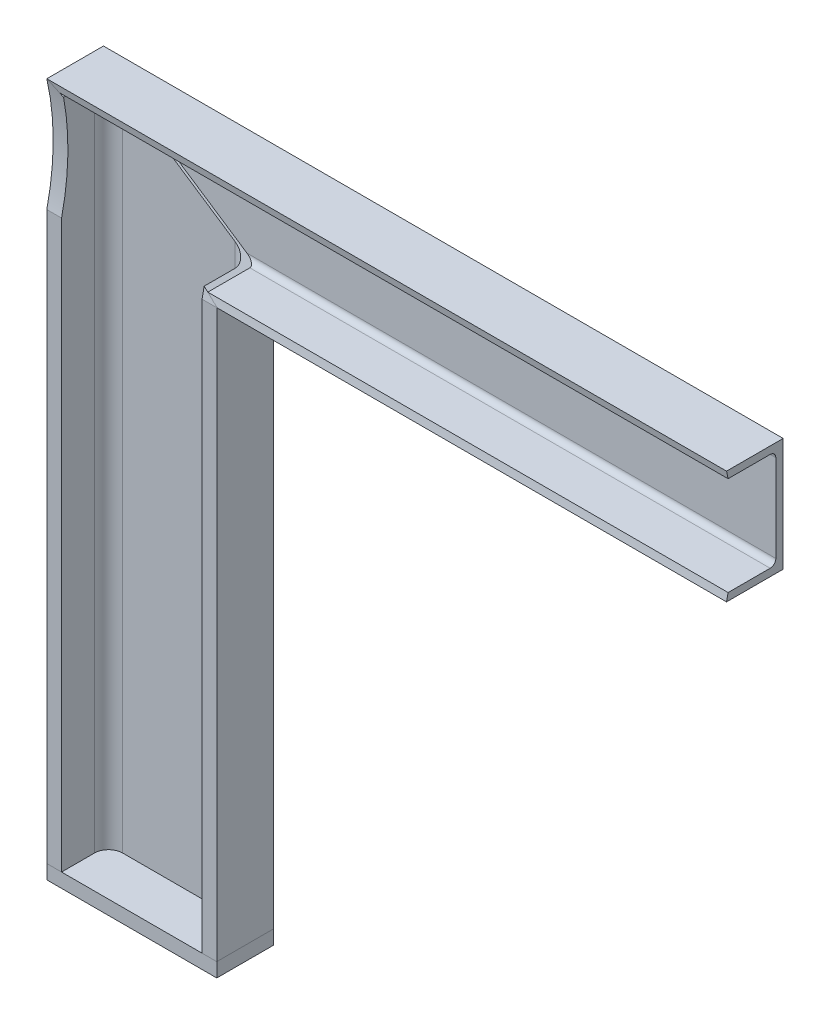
ISO-10303-21;
HEADER;
FILE_DESCRIPTION(('STEP AP214'),'2;1');
FILE_NAME('part.step','',(''),(''),'','','');
FILE_SCHEMA(('AUTOMOTIVE_DESIGN { 1 0 10303 214 1 1 1 1 }'));
ENDSEC;
DATA;
#1=APPLICATION_CONTEXT('core data for automotive mechanical design processes');
#2=APPLICATION_PROTOCOL_DEFINITION('international standard','automotive_design',2000,#1);
#3=PRODUCT_CONTEXT('',#1,'mechanical');
#4=PRODUCT('Part','Part','',(#3));
#5=PRODUCT_RELATED_PRODUCT_CATEGORY('part','',(#4));
#6=PRODUCT_DEFINITION_FORMATION('','',#4);
#7=PRODUCT_DEFINITION_CONTEXT('part definition',#1,'design');
#8=PRODUCT_DEFINITION('design','',#6,#7);
#9=PRODUCT_DEFINITION_SHAPE('','',#8);
#10=(LENGTH_UNIT() NAMED_UNIT(*) SI_UNIT(.MILLI.,.METRE.));
#11=(NAMED_UNIT(*) PLANE_ANGLE_UNIT() SI_UNIT($,.RADIAN.));
#12=(NAMED_UNIT(*) SI_UNIT($,.STERADIAN.) SOLID_ANGLE_UNIT());
#13=UNCERTAINTY_MEASURE_WITH_UNIT(LENGTH_MEASURE(1.E-05),#10,'distance_accuracy_value','');
#14=(GEOMETRIC_REPRESENTATION_CONTEXT(3) GLOBAL_UNCERTAINTY_ASSIGNED_CONTEXT((#13)) GLOBAL_UNIT_ASSIGNED_CONTEXT((#10,
#11,#12)) REPRESENTATION_CONTEXT('',''));
#15=CARTESIAN_POINT('',(0.,0.,0.));
#16=DIRECTION('',(0.,0.,1.));
#17=DIRECTION('',(1.,0.,0.));
#18=AXIS2_PLACEMENT_3D('',#15,#16,#17);
#19=CARTESIAN_POINT('',(-25.0909553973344,-279.402062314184,0.));
#20=DIRECTION('',(1.,0.,0.));
#21=DIRECTION('',(0.,1.,0.));
#22=AXIS2_PLACEMENT_3D('',#19,#20,#21);
#23=PLANE('',#22);
#24=DIRECTION('',(0.,0.,-1.));
#25=VECTOR('',#24,1.);
#26=CARTESIAN_POINT('',(-25.0909553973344,-273.052062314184,0.));
#27=LINE('',#26,#25);
#28=CARTESIAN_POINT('',(-25.0909553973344,-273.052062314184,25.4));
#29=VERTEX_POINT('',#28);
#30=CARTESIAN_POINT('',(-25.0909553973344,-273.052062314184,0.));
#31=VERTEX_POINT('',#30);
#32=EDGE_CURVE('E108',#29,#31,#27,.T.);
#33=ORIENTED_EDGE('',*,*,#32,.T.);
#34=DIRECTION('',(0.,1.,0.));
#35=VECTOR('',#34,1.);
#36=CARTESIAN_POINT('',(-25.0909553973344,-279.402062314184,0.));
#37=LINE('',#36,#35);
#38=CARTESIAN_POINT('',(-25.0909553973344,-279.402062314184,0.));
#39=VERTEX_POINT('',#38);
#40=EDGE_CURVE('E12',#39,#31,#37,.T.);
#41=ORIENTED_EDGE('',*,*,#40,.F.);
#42=DIRECTION('',(0.,0.,-1.));
#43=VECTOR('',#42,1.);
#44=CARTESIAN_POINT('',(-25.0909553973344,-279.402062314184,0.));
#45=LINE('',#44,#43);
#46=CARTESIAN_POINT('',(-25.0909553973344,-279.402062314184,25.4));
#47=VERTEX_POINT('',#46);
#48=EDGE_CURVE('E96',#47,#39,#45,.T.);
#49=ORIENTED_EDGE('',*,*,#48,.F.);
#50=DIRECTION('',(0.,1.,0.));
#51=VECTOR('',#50,1.);
#52=CARTESIAN_POINT('',(-25.0909553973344,-279.402062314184,25.4));
#53=LINE('',#52,#51);
#54=EDGE_CURVE('E104',#47,#29,#53,.T.);
#55=ORIENTED_EDGE('',*,*,#54,.T.);
#56=EDGE_LOOP('',(#33,#41,#49,#55));
#57=FACE_BOUND('',#56,.T.);
#58=ADVANCED_FACE('F45',(#57),#23,.F.);
#59=CARTESIAN_POINT('',(-25.0909553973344,-279.402062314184,0.));
#60=DIRECTION('',(0.,0.,1.));
#61=DIRECTION('',(1.,0.,0.));
#62=AXIS2_PLACEMENT_3D('',#59,#60,#61);
#63=PLANE('',#62);
#64=DIRECTION('',(1.,0.,0.));
#65=VECTOR('',#64,1.);
#66=CARTESIAN_POINT('',(-25.0909553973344,-273.052062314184,0.));
#67=LINE('',#66,#65);
#68=CARTESIAN_POINT('',(51.1090446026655,-273.052062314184,0.));
#69=VERTEX_POINT('',#68);
#70=EDGE_CURVE('E100',#31,#69,#67,.T.);
#71=ORIENTED_EDGE('',*,*,#70,.T.);
#72=DIRECTION('',(0.,1.,0.));
#73=VECTOR('',#72,1.);
#74=CARTESIAN_POINT('',(51.1090446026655,-279.402062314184,0.));
#75=LINE('',#74,#73);
#76=CARTESIAN_POINT('',(51.1090446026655,-279.402062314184,0.));
#77=VERTEX_POINT('',#76);
#78=EDGE_CURVE('E53',#77,#69,#75,.T.);
#79=ORIENTED_EDGE('',*,*,#78,.F.);
#80=DIRECTION('',(1.,0.,0.));
#81=VECTOR('',#80,1.);
#82=CARTESIAN_POINT('',(-25.0909553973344,-279.402062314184,0.));
#83=LINE('',#82,#81);
#84=EDGE_CURVE('E91',#39,#77,#83,.T.);
#85=ORIENTED_EDGE('',*,*,#84,.F.);
#86=ORIENTED_EDGE('',*,*,#40,.T.);
#87=EDGE_LOOP('',(#71,#79,#85,#86));
#88=FACE_BOUND('',#87,.T.);
#89=ADVANCED_FACE('F99',(#88),#63,.F.);
#90=CARTESIAN_POINT('',(51.1090446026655,-279.402062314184,0.));
#91=DIRECTION('',(-1.,0.,0.));
#92=DIRECTION('',(0.,-1.,0.));
#93=AXIS2_PLACEMENT_3D('',#90,#91,#92);
#94=PLANE('',#93);
#95=DIRECTION('',(0.,0.,1.));
#96=VECTOR('',#95,1.);
#97=CARTESIAN_POINT('',(51.1090446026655,-273.052062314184,0.));
#98=LINE('',#97,#96);
#99=CARTESIAN_POINT('',(51.1090446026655,-273.052062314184,25.4));
#100=VERTEX_POINT('',#99);
#101=EDGE_CURVE('E78',#69,#100,#98,.T.);
#102=ORIENTED_EDGE('',*,*,#101,.T.);
#103=DIRECTION('',(0.,1.,0.));
#104=VECTOR('',#103,1.);
#105=CARTESIAN_POINT('',(51.1090446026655,-279.402062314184,25.4));
#106=LINE('',#105,#104);
#107=CARTESIAN_POINT('',(51.1090446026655,-279.402062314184,25.4));
#108=VERTEX_POINT('',#107);
#109=EDGE_CURVE('E101',#108,#100,#106,.T.);
#110=ORIENTED_EDGE('',*,*,#109,.F.);
#111=DIRECTION('',(0.,0.,1.));
#112=VECTOR('',#111,1.);
#113=CARTESIAN_POINT('',(51.1090446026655,-279.402062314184,0.));
#114=LINE('',#113,#112);
#115=EDGE_CURVE('E94',#77,#108,#114,.T.);
#116=ORIENTED_EDGE('',*,*,#115,.F.);
#117=ORIENTED_EDGE('',*,*,#78,.T.);
#118=EDGE_LOOP('',(#102,#110,#116,#117));
#119=FACE_BOUND('',#118,.T.);
#120=ADVANCED_FACE('F102',(#119),#94,.F.);
#121=CARTESIAN_POINT('',(-25.0909553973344,-279.402062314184,25.4));
#122=DIRECTION('',(0.,0.,-1.));
#123=DIRECTION('',(-1.,0.,0.));
#124=AXIS2_PLACEMENT_3D('',#121,#122,#123);
#125=PLANE('',#124);
#126=DIRECTION('',(-1.,0.,0.));
#127=VECTOR('',#126,1.);
#128=CARTESIAN_POINT('',(-25.0909553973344,-273.052062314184,25.4));
#129=LINE('',#128,#127);
#130=EDGE_CURVE('E84',#100,#29,#129,.T.);
#131=ORIENTED_EDGE('',*,*,#130,.T.);
#132=ORIENTED_EDGE('',*,*,#54,.F.);
#133=DIRECTION('',(-1.,0.,0.));
#134=VECTOR('',#133,1.);
#135=CARTESIAN_POINT('',(-25.0909553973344,-279.402062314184,25.4));
#136=LINE('',#135,#134);
#137=EDGE_CURVE('E61',#108,#47,#136,.T.);
#138=ORIENTED_EDGE('',*,*,#137,.F.);
#139=ORIENTED_EDGE('',*,*,#109,.T.);
#140=EDGE_LOOP('',(#131,#132,#138,#139));
#141=FACE_BOUND('',#140,.T.);
#142=ADVANCED_FACE('F115',(#141),#125,.F.);
#143=CARTESIAN_POINT('',(-25.0909553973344,-279.402062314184,25.4));
#144=DIRECTION('',(0.,1.,0.));
#145=DIRECTION('',(0.,0.,1.));
#146=AXIS2_PLACEMENT_3D('',#143,#144,#145);
#147=PLANE('',#146);
#148=ORIENTED_EDGE('',*,*,#48,.T.);
#149=ORIENTED_EDGE('',*,*,#84,.T.);
#150=ORIENTED_EDGE('',*,*,#115,.T.);
#151=ORIENTED_EDGE('',*,*,#137,.T.);
#152=EDGE_LOOP('',(#148,#149,#150,#151));
#153=FACE_BOUND('',#152,.T.);
#154=ADVANCED_FACE('F92',(#153),#147,.F.);
#155=CARTESIAN_POINT('',(-25.0909553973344,-273.052062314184,25.4));
#156=DIRECTION('',(0.,1.,0.));
#157=DIRECTION('',(0.,0.,1.));
#158=AXIS2_PLACEMENT_3D('',#155,#156,#157);
#159=PLANE('',#158);
#160=ORIENTED_EDGE('',*,*,#32,.F.);
#161=ORIENTED_EDGE('',*,*,#130,.F.);
#162=ORIENTED_EDGE('',*,*,#101,.F.);
#163=ORIENTED_EDGE('',*,*,#70,.F.);
#164=EDGE_LOOP('',(#160,#161,#162,#163));
#165=FACE_BOUND('',#164,.T.);
#166=ADVANCED_FACE('F118',(#165),#159,.T.);
#167=CLOSED_SHELL('',(#58,#89,#120,#142,#154,#166));
#168=MANIFOLD_SOLID_BREP('B2',#167);
#169=CARTESIAN_POINT('',(-25.0909553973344,-273.052062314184,0.));
#170=DIRECTION('',(1.,0.,0.));
#171=DIRECTION('',(0.,1.,0.));
#172=AXIS2_PLACEMENT_3D('',#169,#170,#171);
#173=PLANE('',#172);
#174=DIRECTION('',(0.,1.,0.));
#175=VECTOR('',#174,1.);
#176=CARTESIAN_POINT('',(-25.0909553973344,-273.052062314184,25.4));
#177=LINE('',#176,#175);
#178=CARTESIAN_POINT('',(-25.0909553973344,-273.052062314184,25.4));
#179=VERTEX_POINT('',#178);
#180=CARTESIAN_POINT('',(-25.0909553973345,-19.0520623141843,25.4));
#181=VERTEX_POINT('',#180);
#182=EDGE_CURVE('E317',#179,#181,#177,.T.);
#183=ORIENTED_EDGE('',*,*,#182,.T.);
#184=CARTESIAN_POINT('',(-25.0909553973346,6.34793768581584,136.84204771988));
#185=DIRECTION('',(1.,0.,0.));
#186=DIRECTION('',(0.,1.,0.));
#187=AXIS2_PLACEMENT_3D('',#184,#185,#186);
#188=CIRCLE('',#187,114.3);
#189=CARTESIAN_POINT('',(-25.0909553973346,31.747937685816,25.4));
#190=VERTEX_POINT('',#189);
#191=EDGE_CURVE('E190',#181,#190,#188,.T.);
#192=ORIENTED_EDGE('',*,*,#191,.T.);
#193=DIRECTION('',(0.,0.,-1.));
#194=VECTOR('',#193,1.);
#195=CARTESIAN_POINT('',(-25.0909553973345,31.7479376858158,0.));
#196=LINE('',#195,#194);
#197=CARTESIAN_POINT('',(-25.0909553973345,31.7479376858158,0.));
#198=VERTEX_POINT('',#197);
#199=EDGE_CURVE('E312',#190,#198,#196,.T.);
#200=ORIENTED_EDGE('',*,*,#199,.T.);
#201=DIRECTION('',(0.,1.,0.));
#202=VECTOR('',#201,1.);
#203=CARTESIAN_POINT('',(-25.0909553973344,-273.052062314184,0.));
#204=LINE('',#203,#202);
#205=CARTESIAN_POINT('',(-25.0909553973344,-273.052062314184,0.));
#206=VERTEX_POINT('',#205);
#207=EDGE_CURVE('E286',#206,#198,#204,.T.);
#208=ORIENTED_EDGE('',*,*,#207,.F.);
#209=DIRECTION('',(0.,0.,-1.));
#210=VECTOR('',#209,1.);
#211=CARTESIAN_POINT('',(-25.0909553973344,-273.052062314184,0.));
#212=LINE('',#211,#210);
#213=EDGE_CURVE('E315',#179,#206,#212,.T.);
#214=ORIENTED_EDGE('',*,*,#213,.F.);
#215=EDGE_LOOP('',(#183,#192,#200,#208,#214));
#216=FACE_BOUND('',#215,.T.);
#217=ADVANCED_FACE('F177',(#216),#173,.F.);
#218=CARTESIAN_POINT('',(-25.0909553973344,-273.052062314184,0.));
#219=DIRECTION('',(0.,0.,1.));
#220=DIRECTION('',(1.,0.,0.));
#221=AXIS2_PLACEMENT_3D('',#218,#219,#220);
#222=PLANE('',#221);
#223=ORIENTED_EDGE('',*,*,#207,.T.);
#224=DIRECTION('',(-0.832876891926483,0.55345829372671,0.));
#225=VECTOR('',#224,1.);
#226=CARTESIAN_POINT('',(-25.0909553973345,31.7479376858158,0.));
#227=LINE('',#226,#225);
#228=CARTESIAN_POINT('',(51.1090446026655,-18.888023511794,0.));
#229=VERTEX_POINT('',#228);
#230=EDGE_CURVE('E270',#229,#198,#227,.T.);
#231=ORIENTED_EDGE('',*,*,#230,.F.);
#232=DIRECTION('',(0.,1.,0.));
#233=VECTOR('',#232,1.);
#234=CARTESIAN_POINT('',(51.1090446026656,-273.052062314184,0.));
#235=LINE('',#234,#233);
#236=CARTESIAN_POINT('',(51.1090446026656,-273.052062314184,0.));
#237=VERTEX_POINT('',#236);
#238=EDGE_CURVE('E283',#237,#229,#235,.T.);
#239=ORIENTED_EDGE('',*,*,#238,.F.);
#240=DIRECTION('',(1.,0.,0.));
#241=VECTOR('',#240,1.);
#242=CARTESIAN_POINT('',(-25.0909553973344,-273.052062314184,0.));
#243=LINE('',#242,#241);
#244=EDGE_CURVE('E322',#206,#237,#243,.T.);
#245=ORIENTED_EDGE('',*,*,#244,.F.);
#246=EDGE_LOOP('',(#223,#231,#239,#245));
#247=FACE_BOUND('',#246,.T.);
#248=ADVANCED_FACE('F281',(#247),#222,.F.);
#249=CARTESIAN_POINT('',(51.1090446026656,-273.052062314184,0.));
#250=DIRECTION('',(-1.,0.,0.));
#251=DIRECTION('',(0.,-1.,0.));
#252=AXIS2_PLACEMENT_3D('',#249,#250,#251);
#253=PLANE('',#252);
#254=ORIENTED_EDGE('',*,*,#238,.T.);
#255=DIRECTION('',(0.,0.,-1.));
#256=VECTOR('',#255,1.);
#257=CARTESIAN_POINT('',(51.1090446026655,-18.888023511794,25.4));
#258=LINE('',#257,#256);
#259=CARTESIAN_POINT('',(51.1090446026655,-18.888023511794,25.362739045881));
#260=VERTEX_POINT('',#259);
#261=EDGE_CURVE('E267',#260,#229,#258,.T.);
#262=ORIENTED_EDGE('',*,*,#261,.F.);
#263=CARTESIAN_POINT('',(51.1090446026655,6.34793768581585,136.84204771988));
#264=DIRECTION('',(-1.,0.,0.));
#265=DIRECTION('',(0.,-1.,0.));
#266=AXIS2_PLACEMENT_3D('',#263,#264,#265);
#267=CIRCLE('',#266,114.3);
#268=CARTESIAN_POINT('',(51.1090446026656,-19.0520623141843,25.4));
#269=VERTEX_POINT('',#268);
#270=EDGE_CURVE('E363',#260,#269,#267,.T.);
#271=ORIENTED_EDGE('',*,*,#270,.T.);
#272=DIRECTION('',(0.,1.,0.));
#273=VECTOR('',#272,1.);
#274=CARTESIAN_POINT('',(51.1090446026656,-273.052062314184,25.4));
#275=LINE('',#274,#273);
#276=CARTESIAN_POINT('',(51.1090446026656,-273.052062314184,25.4));
#277=VERTEX_POINT('',#276);
#278=EDGE_CURVE('E305',#277,#269,#275,.T.);
#279=ORIENTED_EDGE('',*,*,#278,.F.);
#280=DIRECTION('',(0.,0.,1.));
#281=VECTOR('',#280,1.);
#282=CARTESIAN_POINT('',(51.1090446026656,-273.052062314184,0.));
#283=LINE('',#282,#281);
#284=EDGE_CURVE('E291',#237,#277,#283,.T.);
#285=ORIENTED_EDGE('',*,*,#284,.F.);
#286=EDGE_LOOP('',(#254,#262,#271,#279,#285));
#287=FACE_BOUND('',#286,.T.);
#288=ADVANCED_FACE('F288',(#287),#253,.F.);
#289=CARTESIAN_POINT('',(44.5050446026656,-273.052062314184,10.668));
#290=DIRECTION('',(1.,0.,0.));
#291=DIRECTION('',(0.,1.,0.));
#292=AXIS2_PLACEMENT_3D('',#289,#290,#291);
#293=PLANE('',#292);
#294=CARTESIAN_POINT('',(44.5050446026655,6.34793768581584,136.84204771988));
#295=DIRECTION('',(1.,0.,0.));
#296=DIRECTION('',(0.,1.,0.));
#297=AXIS2_PLACEMENT_3D('',#294,#295,#296);
#298=CIRCLE('',#297,114.3);
#299=CARTESIAN_POINT('',(44.5050446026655,-19.0520623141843,25.4));
#300=VERTEX_POINT('',#299);
#301=CARTESIAN_POINT('',(44.5050446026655,-14.4995735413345,24.4593476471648));
#302=VERTEX_POINT('',#301);
#303=EDGE_CURVE('E198',#300,#302,#298,.T.);
#304=ORIENTED_EDGE('',*,*,#303,.T.);
#305=DIRECTION('',(0.,0.,-1.));
#306=VECTOR('',#305,1.);
#307=CARTESIAN_POINT('',(44.5050446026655,-14.4995735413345,10.668));
#308=LINE('',#307,#306);
#309=CARTESIAN_POINT('',(44.5050446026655,-14.4995735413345,10.668));
#310=VERTEX_POINT('',#309);
#311=EDGE_CURVE('E353',#302,#310,#308,.T.);
#312=ORIENTED_EDGE('',*,*,#311,.T.);
#313=DIRECTION('',(0.,1.,0.));
#314=VECTOR('',#313,1.);
#315=CARTESIAN_POINT('',(44.5050446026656,-273.052062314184,10.668));
#316=LINE('',#315,#314);
#317=CARTESIAN_POINT('',(44.5050446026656,-273.052062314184,10.668));
#318=VERTEX_POINT('',#317);
#319=EDGE_CURVE('E292',#318,#310,#316,.T.);
#320=ORIENTED_EDGE('',*,*,#319,.F.);
#321=DIRECTION('',(0.,0.,-1.));
#322=VECTOR('',#321,1.);
#323=CARTESIAN_POINT('',(44.5050446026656,-273.052062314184,10.668));
#324=LINE('',#323,#322);
#325=CARTESIAN_POINT('',(44.5050446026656,-273.052062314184,25.4));
#326=VERTEX_POINT('',#325);
#327=EDGE_CURVE('E311',#326,#318,#324,.T.);
#328=ORIENTED_EDGE('',*,*,#327,.F.);
#329=DIRECTION('',(0.,1.,0.));
#330=VECTOR('',#329,1.);
#331=CARTESIAN_POINT('',(44.5050446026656,-273.052062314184,25.4));
#332=LINE('',#331,#330);
#333=EDGE_CURVE('E303',#326,#300,#332,.T.);
#334=ORIENTED_EDGE('',*,*,#333,.T.);
#335=EDGE_LOOP('',(#304,#312,#320,#328,#334));
#336=FACE_BOUND('',#335,.T.);
#337=ADVANCED_FACE('F308',(#336),#293,.F.);
#338=CARTESIAN_POINT('',(38.1550446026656,-273.052062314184,10.668));
#339=DIRECTION('',(0.,1.,0.));
#340=DIRECTION('',(-1.,0.,0.));
#341=AXIS2_PLACEMENT_3D('',#338,#339,#340);
#342=CYLINDRICAL_SURFACE('',#341,6.35);
#343=ORIENTED_EDGE('',*,*,#319,.T.);
#344=CARTESIAN_POINT('',(38.1550446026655,-10.2799101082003,10.668));
#345=DIRECTION('',(-0.55345829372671,-0.832876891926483,0.));
#346=DIRECTION('',(-0.832876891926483,0.55345829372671,0.));
#347=AXIS2_PLACEMENT_3D('',#344,#345,#346);
#348=ELLIPSE('',#347,7.6241759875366,6.35);
#349=CARTESIAN_POINT('',(38.1550446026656,-10.2799101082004,4.318));
#350=VERTEX_POINT('',#349);
#351=EDGE_CURVE('E352',#310,#350,#348,.F.);
#352=ORIENTED_EDGE('',*,*,#351,.T.);
#353=DIRECTION('',(0.,1.,0.));
#354=VECTOR('',#353,1.);
#355=CARTESIAN_POINT('',(38.1550446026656,-273.052062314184,4.318));
#356=LINE('',#355,#354);
#357=CARTESIAN_POINT('',(38.1550446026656,-273.052062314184,4.318));
#358=VERTEX_POINT('',#357);
#359=EDGE_CURVE('E296',#358,#350,#356,.T.);
#360=ORIENTED_EDGE('',*,*,#359,.F.);
#361=CARTESIAN_POINT('',(38.1550446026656,-273.052062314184,10.668));
#362=DIRECTION('',(0.,1.,0.));
#363=DIRECTION('',(1.,0.,0.));
#364=AXIS2_PLACEMENT_3D('',#361,#362,#363);
#365=CIRCLE('',#364,6.35);
#366=EDGE_CURVE('E326',#318,#358,#365,.T.);
#367=ORIENTED_EDGE('',*,*,#366,.F.);
#368=EDGE_LOOP('',(#343,#352,#360,#367));
#369=FACE_BOUND('',#368,.T.);
#370=ADVANCED_FACE('F351',(#369),#342,.F.);
#371=CARTESIAN_POINT('',(-12.1369553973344,-273.052062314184,4.318));
#372=DIRECTION('',(0.,0.,-1.));
#373=DIRECTION('',(-1.,0.,0.));
#374=AXIS2_PLACEMENT_3D('',#371,#372,#373);
#375=PLANE('',#374);
#376=ORIENTED_EDGE('',*,*,#359,.T.);
#377=DIRECTION('',(-0.832876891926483,0.55345829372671,0.));
#378=VECTOR('',#377,1.);
#379=CARTESIAN_POINT('',(124.396433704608,-67.5885142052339,4.318));
#380=LINE('',#379,#378);
#381=CARTESIAN_POINT('',(-12.1369553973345,23.1398242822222,4.318));
#382=VERTEX_POINT('',#381);
#383=EDGE_CURVE('E347',#350,#382,#380,.T.);
#384=ORIENTED_EDGE('',*,*,#383,.T.);
#385=DIRECTION('',(0.,1.,0.));
#386=VECTOR('',#385,1.);
#387=CARTESIAN_POINT('',(-12.1369553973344,-273.052062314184,4.318));
#388=LINE('',#387,#386);
#389=CARTESIAN_POINT('',(-12.1369553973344,-273.052062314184,4.318));
#390=VERTEX_POINT('',#389);
#391=EDGE_CURVE('E338',#390,#382,#388,.T.);
#392=ORIENTED_EDGE('',*,*,#391,.F.);
#393=DIRECTION('',(-1.,0.,0.));
#394=VECTOR('',#393,1.);
#395=CARTESIAN_POINT('',(-12.1369553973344,-273.052062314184,4.318));
#396=LINE('',#395,#394);
#397=EDGE_CURVE('E328',#358,#390,#396,.T.);
#398=ORIENTED_EDGE('',*,*,#397,.F.);
#399=EDGE_LOOP('',(#376,#384,#392,#398));
#400=FACE_BOUND('',#399,.T.);
#401=ADVANCED_FACE('F345',(#400),#375,.F.);
#402=CARTESIAN_POINT('',(-12.1369553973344,-273.052062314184,10.668));
#403=DIRECTION('',(0.,1.,0.));
#404=DIRECTION('',(-1.,0.,0.));
#405=AXIS2_PLACEMENT_3D('',#402,#403,#404);
#406=CYLINDRICAL_SURFACE('',#405,6.35);
#407=ORIENTED_EDGE('',*,*,#391,.T.);
#408=CARTESIAN_POINT('',(-12.1369553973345,23.1398242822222,10.668));
#409=DIRECTION('',(-0.55345829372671,-0.832876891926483,0.));
#410=DIRECTION('',(-0.832876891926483,0.55345829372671,0.));
#411=AXIS2_PLACEMENT_3D('',#408,#409,#410);
#412=ELLIPSE('',#411,7.62417598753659,6.35);
#413=CARTESIAN_POINT('',(-18.4869553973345,27.3594877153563,10.668));
#414=VERTEX_POINT('',#413);
#415=EDGE_CURVE('E356',#382,#414,#412,.F.);
#416=ORIENTED_EDGE('',*,*,#415,.T.);
#417=DIRECTION('',(0.,1.,0.));
#418=VECTOR('',#417,1.);
#419=CARTESIAN_POINT('',(-18.4869553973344,-273.052062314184,10.668));
#420=LINE('',#419,#418);
#421=CARTESIAN_POINT('',(-18.4869553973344,-273.052062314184,10.668));
#422=VERTEX_POINT('',#421);
#423=EDGE_CURVE('E334',#422,#414,#420,.T.);
#424=ORIENTED_EDGE('',*,*,#423,.F.);
#425=CARTESIAN_POINT('',(-12.1369553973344,-273.052062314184,10.668));
#426=DIRECTION('',(0.,1.,0.));
#427=DIRECTION('',(-1.,0.,0.));
#428=AXIS2_PLACEMENT_3D('',#425,#426,#427);
#429=CIRCLE('',#428,6.35);
#430=EDGE_CURVE('E330',#390,#422,#429,.T.);
#431=ORIENTED_EDGE('',*,*,#430,.F.);
#432=EDGE_LOOP('',(#407,#416,#424,#431));
#433=FACE_BOUND('',#432,.T.);
#434=ADVANCED_FACE('F414',(#433),#406,.F.);
#435=CARTESIAN_POINT('',(-18.4869553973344,-273.052062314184,10.668));
#436=DIRECTION('',(-1.,0.,0.));
#437=DIRECTION('',(0.,-1.,0.));
#438=AXIS2_PLACEMENT_3D('',#435,#436,#437);
#439=PLANE('',#438);
#440=ORIENTED_EDGE('',*,*,#423,.T.);
#441=DIRECTION('',(0.,0.,1.));
#442=VECTOR('',#441,1.);
#443=CARTESIAN_POINT('',(-18.4869553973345,27.3594877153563,10.668));
#444=LINE('',#443,#442);
#445=CARTESIAN_POINT('',(-18.4869553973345,27.3594877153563,24.4899014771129));
#446=VERTEX_POINT('',#445);
#447=EDGE_CURVE('E276',#414,#446,#444,.T.);
#448=ORIENTED_EDGE('',*,*,#447,.T.);
#449=CARTESIAN_POINT('',(-18.4869553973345,6.34793768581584,136.84204771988));
#450=DIRECTION('',(-1.,0.,0.));
#451=DIRECTION('',(0.,-1.,0.));
#452=AXIS2_PLACEMENT_3D('',#449,#450,#451);
#453=CIRCLE('',#452,114.3);
#454=CARTESIAN_POINT('',(-18.4869553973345,-19.0520623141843,25.4));
#455=VERTEX_POINT('',#454);
#456=EDGE_CURVE('E367',#446,#455,#453,.T.);
#457=ORIENTED_EDGE('',*,*,#456,.T.);
#458=DIRECTION('',(0.,-1.,0.));
#459=VECTOR('',#458,1.);
#460=CARTESIAN_POINT('',(-18.4869553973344,-273.052062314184,25.4));
#461=LINE('',#460,#459);
#462=CARTESIAN_POINT('',(-18.4869553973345,-273.052062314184,25.4));
#463=VERTEX_POINT('',#462);
#464=EDGE_CURVE('E313',#455,#463,#461,.T.);
#465=ORIENTED_EDGE('',*,*,#464,.T.);
#466=DIRECTION('',(0.,0.,1.));
#467=VECTOR('',#466,1.);
#468=CARTESIAN_POINT('',(-18.4869553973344,-273.052062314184,10.668));
#469=LINE('',#468,#467);
#470=EDGE_CURVE('E332',#422,#463,#469,.T.);
#471=ORIENTED_EDGE('',*,*,#470,.F.);
#472=EDGE_LOOP('',(#440,#448,#457,#465,#471));
#473=FACE_BOUND('',#472,.T.);
#474=ADVANCED_FACE('F386',(#473),#439,.F.);
#475=CARTESIAN_POINT('',(-12.1369553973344,-273.052062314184,10.668));
#476=DIRECTION('',(0.,1.,0.));
#477=DIRECTION('',(-1.,0.,0.));
#478=AXIS2_PLACEMENT_3D('',#475,#476,#477);
#479=PLANE('',#478);
#480=ORIENTED_EDGE('',*,*,#284,.T.);
#481=DIRECTION('',(-1.,0.,0.));
#482=VECTOR('',#481,1.);
#483=CARTESIAN_POINT('',(51.1090446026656,-273.052062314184,25.4));
#484=LINE('',#483,#482);
#485=EDGE_CURVE('E370',#277,#326,#484,.T.);
#486=ORIENTED_EDGE('',*,*,#485,.T.);
#487=ORIENTED_EDGE('',*,*,#327,.T.);
#488=ORIENTED_EDGE('',*,*,#366,.T.);
#489=ORIENTED_EDGE('',*,*,#397,.T.);
#490=ORIENTED_EDGE('',*,*,#430,.T.);
#491=ORIENTED_EDGE('',*,*,#470,.T.);
#492=EDGE_CURVE('E369',#463,#179,#484,.T.);
#493=ORIENTED_EDGE('',*,*,#492,.T.);
#494=ORIENTED_EDGE('',*,*,#213,.T.);
#495=ORIENTED_EDGE('',*,*,#244,.T.);
#496=EDGE_LOOP('',(#480,#486,#487,#488,#489,#490,#491,#493,#494,#495));
#497=FACE_BOUND('',#496,.T.);
#498=ADVANCED_FACE('F381',(#497),#479,.F.);
#499=CARTESIAN_POINT('',(51.1090446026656,-273.052062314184,25.4));
#500=DIRECTION('',(0.,0.,-1.));
#501=DIRECTION('',(-1.,0.,0.));
#502=AXIS2_PLACEMENT_3D('',#499,#500,#501);
#503=PLANE('',#502);
#504=ORIENTED_EDGE('',*,*,#464,.F.);
#505=DIRECTION('',(1.,0.,0.));
#506=VECTOR('',#505,1.);
#507=CARTESIAN_POINT('',(-25.0909553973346,-19.0520623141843,25.4));
#508=LINE('',#507,#506);
#509=EDGE_CURVE('E365',#455,#181,#508,.F.);
#510=ORIENTED_EDGE('',*,*,#509,.T.);
#511=ORIENTED_EDGE('',*,*,#182,.F.);
#512=ORIENTED_EDGE('',*,*,#492,.F.);
#513=EDGE_LOOP('',(#504,#510,#511,#512));
#514=FACE_BOUND('',#513,.T.);
#515=ADVANCED_FACE('F379',(#514),#503,.F.);
#516=ORIENTED_EDGE('',*,*,#278,.T.);
#517=DIRECTION('',(1.,0.,0.));
#518=VECTOR('',#517,1.);
#519=CARTESIAN_POINT('',(-25.0909553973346,-19.0520623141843,25.4));
#520=LINE('',#519,#518);
#521=EDGE_CURVE('E184',#269,#300,#520,.F.);
#522=ORIENTED_EDGE('',*,*,#521,.T.);
#523=ORIENTED_EDGE('',*,*,#333,.F.);
#524=ORIENTED_EDGE('',*,*,#485,.F.);
#525=EDGE_LOOP('',(#516,#522,#523,#524));
#526=FACE_BOUND('',#525,.T.);
#527=ADVANCED_FACE('F302',(#526),#503,.F.);
#528=CARTESIAN_POINT('',(-25.0909553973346,6.34793768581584,136.84204771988));
#529=DIRECTION('',(1.,0.,0.));
#530=DIRECTION('',(0.,1.,0.));
#531=AXIS2_PLACEMENT_3D('',#528,#529,#530);
#532=CYLINDRICAL_SURFACE('',#531,114.3);
#533=ORIENTED_EDGE('',*,*,#270,.F.);
#534=CARTESIAN_POINT('',(13.132472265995,6.34793768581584,136.84204771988));
#535=DIRECTION('',(-0.55345829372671,-0.832876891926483,0.));
#536=DIRECTION('',(0.832876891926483,-0.55345829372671,0.));
#537=AXIS2_PLACEMENT_3D('',#534,#535,#536);
#538=ELLIPSE('',#537,206.519626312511,114.3);
#539=EDGE_CURVE('E272',#260,#302,#538,.F.);
#540=ORIENTED_EDGE('',*,*,#539,.T.);
#541=ORIENTED_EDGE('',*,*,#303,.F.);
#542=ORIENTED_EDGE('',*,*,#521,.F.);
#543=EDGE_LOOP('',(#533,#540,#541,#542));
#544=FACE_BOUND('',#543,.T.);
#545=ADVANCED_FACE('F391',(#544),#532,.F.);
#546=ORIENTED_EDGE('',*,*,#456,.F.);
#547=CARTESIAN_POINT('',(13.132472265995,6.34793768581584,136.84204771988));
#548=DIRECTION('',(-0.55345829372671,-0.832876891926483,0.));
#549=DIRECTION('',(0.832876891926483,-0.55345829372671,0.));
#550=AXIS2_PLACEMENT_3D('',#547,#548,#549);
#551=ELLIPSE('',#550,206.519626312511,114.3);
#552=EDGE_CURVE('E43',#446,#190,#551,.F.);
#553=ORIENTED_EDGE('',*,*,#552,.T.);
#554=ORIENTED_EDGE('',*,*,#191,.F.);
#555=ORIENTED_EDGE('',*,*,#509,.F.);
#556=EDGE_LOOP('',(#546,#553,#554,#555));
#557=FACE_BOUND('',#556,.T.);
#558=ADVANCED_FACE('F389',(#557),#532,.F.);
#559=CARTESIAN_POINT('',(-25.0909553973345,31.7479376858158,25.4));
#560=DIRECTION('',(-0.55345829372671,-0.832876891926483,0.));
#561=DIRECTION('',(0.832876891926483,-0.55345829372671,0.));
#562=AXIS2_PLACEMENT_3D('',#559,#560,#561);
#563=PLANE('',#562);
#564=ORIENTED_EDGE('',*,*,#261,.T.);
#565=ORIENTED_EDGE('',*,*,#230,.T.);
#566=ORIENTED_EDGE('',*,*,#199,.F.);
#567=ORIENTED_EDGE('',*,*,#552,.F.);
#568=ORIENTED_EDGE('',*,*,#447,.F.);
#569=ORIENTED_EDGE('',*,*,#415,.F.);
#570=ORIENTED_EDGE('',*,*,#383,.F.);
#571=ORIENTED_EDGE('',*,*,#351,.F.);
#572=ORIENTED_EDGE('',*,*,#311,.F.);
#573=ORIENTED_EDGE('',*,*,#539,.F.);
#574=EDGE_LOOP('',(#564,#565,#566,#567,#568,#569,#570,#571,#572,#573));
#575=FACE_BOUND('',#574,.T.);
#576=ADVANCED_FACE('F269',(#575),#563,.F.);
#577=CLOSED_SHELL('',(#217,#248,#288,#337,#370,#401,#434,#474,#498,#515,#527,#545,#558,#576));
#578=MANIFOLD_SOLID_BREP('B6',#577);
#579=CARTESIAN_POINT('',(-25.0909553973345,31.7479376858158,0.));
#580=DIRECTION('',(0.,-1.,0.));
#581=DIRECTION('',(1.,0.,0.));
#582=AXIS2_PLACEMENT_3D('',#579,#580,#581);
#583=PLANE('',#582);
#584=DIRECTION('',(0.,0.,-1.));
#585=VECTOR('',#584,1.);
#586=CARTESIAN_POINT('',(279.709044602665,31.7479376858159,0.));
#587=LINE('',#586,#585);
#588=CARTESIAN_POINT('',(279.709044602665,31.747937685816,25.4));
#589=VERTEX_POINT('',#588);
#590=CARTESIAN_POINT('',(279.709044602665,31.7479376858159,0.));
#591=VERTEX_POINT('',#590);
#592=EDGE_CURVE('E642',#589,#591,#587,.T.);
#593=ORIENTED_EDGE('',*,*,#592,.T.);
#594=DIRECTION('',(1.,0.,0.));
#595=VECTOR('',#594,1.);
#596=CARTESIAN_POINT('',(-25.0909553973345,31.7479376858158,0.));
#597=LINE('',#596,#595);
#598=CARTESIAN_POINT('',(-25.0909553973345,31.7479376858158,0.));
#599=VERTEX_POINT('',#598);
#600=EDGE_CURVE('E614',#599,#591,#597,.T.);
#601=ORIENTED_EDGE('',*,*,#600,.F.);
#602=DIRECTION('',(0.,0.,-1.));
#603=VECTOR('',#602,1.);
#604=CARTESIAN_POINT('',(-25.0909553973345,31.7479376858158,0.));
#605=LINE('',#604,#603);
#606=CARTESIAN_POINT('',(-25.0909553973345,31.7479376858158,25.4));
#607=VERTEX_POINT('',#606);
#608=EDGE_CURVE('E600',#607,#599,#605,.T.);
#609=ORIENTED_EDGE('',*,*,#608,.F.);
#610=DIRECTION('',(1.,0.,0.));
#611=VECTOR('',#610,1.);
#612=CARTESIAN_POINT('',(-25.0909553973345,31.7479376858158,25.4));
#613=LINE('',#612,#611);
#614=EDGE_CURVE('E545',#607,#589,#613,.T.);
#615=ORIENTED_EDGE('',*,*,#614,.T.);
#616=EDGE_LOOP('',(#593,#601,#609,#615));
#617=FACE_BOUND('',#616,.T.);
#618=ADVANCED_FACE('F523',(#617),#583,.F.);
#619=CARTESIAN_POINT('',(-25.0909553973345,31.7479376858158,0.));
#620=DIRECTION('',(0.,0.,1.));
#621=DIRECTION('',(0.,-1.,0.));
#622=AXIS2_PLACEMENT_3D('',#619,#620,#621);
#623=PLANE('',#622);
#624=DIRECTION('',(1.,0.,0.));
#625=VECTOR('',#624,1.);
#626=CARTESIAN_POINT('',(-25.0909553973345,-19.0520623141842,0.));
#627=LINE('',#626,#625);
#628=CARTESIAN_POINT('',(51.1090446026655,-19.0520623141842,0.));
#629=VERTEX_POINT('',#628);
#630=CARTESIAN_POINT('',(279.709044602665,-19.0520623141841,0.));
#631=VERTEX_POINT('',#630);
#632=EDGE_CURVE('E613',#629,#631,#627,.T.);
#633=ORIENTED_EDGE('',*,*,#632,.F.);
#634=DIRECTION('',(0.832050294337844,-0.554700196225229,0.));
#635=VECTOR('',#634,1.);
#636=CARTESIAN_POINT('',(-25.0909553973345,31.7479376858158,0.));
#637=LINE('',#636,#635);
#638=EDGE_CURVE('E666',#599,#629,#637,.T.);
#639=ORIENTED_EDGE('',*,*,#638,.F.);
#640=ORIENTED_EDGE('',*,*,#600,.T.);
#641=DIRECTION('',(0.,-1.,0.));
#642=VECTOR('',#641,1.);
#643=CARTESIAN_POINT('',(279.709044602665,31.7479376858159,0.));
#644=LINE('',#643,#642);
#645=EDGE_CURVE('E644',#591,#631,#644,.T.);
#646=ORIENTED_EDGE('',*,*,#645,.T.);
#647=EDGE_LOOP('',(#633,#639,#640,#646));
#648=FACE_BOUND('',#647,.T.);
#649=ADVANCED_FACE('F699',(#648),#623,.F.);
#650=CARTESIAN_POINT('',(-25.0909553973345,-19.0520623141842,0.));
#651=DIRECTION('',(0.,1.,0.));
#652=DIRECTION('',(-1.,0.,0.));
#653=AXIS2_PLACEMENT_3D('',#650,#651,#652);
#654=PLANE('',#653);
#655=DIRECTION('',(1.,0.,0.));
#656=VECTOR('',#655,1.);
#657=CARTESIAN_POINT('',(-25.0909553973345,-19.0520623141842,25.4));
#658=LINE('',#657,#656);
#659=CARTESIAN_POINT('',(51.1090446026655,-19.0520623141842,25.4));
#660=VERTEX_POINT('',#659);
#661=CARTESIAN_POINT('',(279.709044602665,-19.0520623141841,25.4));
#662=VERTEX_POINT('',#661);
#663=EDGE_CURVE('E610',#660,#662,#658,.T.);
#664=ORIENTED_EDGE('',*,*,#663,.F.);
#665=DIRECTION('',(0.,0.,-1.));
#666=VECTOR('',#665,1.);
#667=CARTESIAN_POINT('',(51.1090446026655,-19.0520623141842,25.4));
#668=LINE('',#667,#666);
#669=EDGE_CURVE('E669',#660,#629,#668,.T.);
#670=ORIENTED_EDGE('',*,*,#669,.T.);
#671=ORIENTED_EDGE('',*,*,#632,.T.);
#672=DIRECTION('',(0.,0.,1.));
#673=VECTOR('',#672,1.);
#674=CARTESIAN_POINT('',(279.709044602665,-19.0520623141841,0.));
#675=LINE('',#674,#673);
#676=EDGE_CURVE('E646',#631,#662,#675,.T.);
#677=ORIENTED_EDGE('',*,*,#676,.T.);
#678=EDGE_LOOP('',(#664,#670,#671,#677));
#679=FACE_BOUND('',#678,.T.);
#680=ADVANCED_FACE('F697',(#679),#654,.F.);
#681=CARTESIAN_POINT('',(-25.0909553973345,-15.7500623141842,5.842));
#682=DIRECTION('',(0.,-1.,0.));
#683=DIRECTION('',(1.,0.,0.));
#684=AXIS2_PLACEMENT_3D('',#681,#682,#683);
#685=PLANE('',#684);
#686=DIRECTION('',(0.,0.,1.));
#687=VECTOR('',#686,1.);
#688=CARTESIAN_POINT('',(46.1560446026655,-15.7500623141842,5.842));
#689=LINE('',#688,#687);
#690=CARTESIAN_POINT('',(46.1560446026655,-15.7500623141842,5.842));
#691=VERTEX_POINT('',#690);
#692=CARTESIAN_POINT('',(46.1560446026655,-15.7500623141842,24.6985307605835));
#693=VERTEX_POINT('',#692);
#694=EDGE_CURVE('E640',#691,#693,#689,.T.);
#695=ORIENTED_EDGE('',*,*,#694,.T.);
#696=DIRECTION('',(1.,0.,0.));
#697=VECTOR('',#696,1.);
#698=CARTESIAN_POINT('',(-25.0909553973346,-15.7500623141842,24.6985307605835));
#699=LINE('',#698,#697);
#700=CARTESIAN_POINT('',(279.709044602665,-15.7500623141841,24.6985307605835));
#701=VERTEX_POINT('',#700);
#702=EDGE_CURVE('E537',#693,#701,#699,.T.);
#703=ORIENTED_EDGE('',*,*,#702,.T.);
#704=DIRECTION('',(0.,0.,-1.));
#705=VECTOR('',#704,1.);
#706=CARTESIAN_POINT('',(279.709044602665,-15.7500623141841,5.842));
#707=LINE('',#706,#705);
#708=CARTESIAN_POINT('',(279.709044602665,-15.7500623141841,5.842));
#709=VERTEX_POINT('',#708);
#710=EDGE_CURVE('E649',#701,#709,#707,.T.);
#711=ORIENTED_EDGE('',*,*,#710,.T.);
#712=DIRECTION('',(1.,0.,0.));
#713=VECTOR('',#712,1.);
#714=CARTESIAN_POINT('',(-25.0909553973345,-15.7500623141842,5.842));
#715=LINE('',#714,#713);
#716=EDGE_CURVE('E607',#691,#709,#715,.T.);
#717=ORIENTED_EDGE('',*,*,#716,.F.);
#718=EDGE_LOOP('',(#695,#703,#711,#717));
#719=FACE_BOUND('',#718,.T.);
#720=ADVANCED_FACE('F664',(#719),#685,.F.);
#721=CARTESIAN_POINT('',(-25.0909553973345,-13.2100623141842,5.842));
#722=DIRECTION('',(1.,0.,0.));
#723=DIRECTION('',(0.,1.,0.));
#724=AXIS2_PLACEMENT_3D('',#721,#722,#723);
#725=CYLINDRICAL_SURFACE('',#724,2.54);
#726=DIRECTION('',(1.,0.,0.));
#727=VECTOR('',#726,1.);
#728=CARTESIAN_POINT('',(-25.0909553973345,-13.2100623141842,3.302));
#729=LINE('',#728,#727);
#730=CARTESIAN_POINT('',(42.3460446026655,-13.2100623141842,3.302));
#731=VERTEX_POINT('',#730);
#732=CARTESIAN_POINT('',(279.709044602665,-13.2100623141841,3.302));
#733=VERTEX_POINT('',#732);
#734=EDGE_CURVE('E582',#731,#733,#729,.T.);
#735=ORIENTED_EDGE('',*,*,#734,.F.);
#736=CARTESIAN_POINT('',(42.3460446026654,-13.2100623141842,5.842));
#737=DIRECTION('',(0.554700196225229,0.832050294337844,0.));
#738=DIRECTION('',(0.832050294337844,-0.554700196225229,0.));
#739=AXIS2_PLACEMENT_3D('',#736,#737,#738);
#740=ELLIPSE('',#739,4.57905011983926,2.54);
#741=EDGE_CURVE('E679',#731,#691,#740,.F.);
#742=ORIENTED_EDGE('',*,*,#741,.T.);
#743=ORIENTED_EDGE('',*,*,#716,.T.);
#744=CARTESIAN_POINT('',(279.709044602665,-13.2100623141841,5.842));
#745=DIRECTION('',(1.,0.,0.));
#746=DIRECTION('',(0.,-1.,0.));
#747=AXIS2_PLACEMENT_3D('',#744,#745,#746);
#748=CIRCLE('',#747,2.54);
#749=EDGE_CURVE('E592',#709,#733,#748,.T.);
#750=ORIENTED_EDGE('',*,*,#749,.T.);
#751=EDGE_LOOP('',(#735,#742,#743,#750));
#752=FACE_BOUND('',#751,.T.);
#753=ADVANCED_FACE('F651',(#752),#725,.F.);
#754=CARTESIAN_POINT('',(-25.0909553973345,25.9059376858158,3.302));
#755=DIRECTION('',(0.,0.,-1.));
#756=DIRECTION('',(-1.,0.,0.));
#757=AXIS2_PLACEMENT_3D('',#754,#755,#756);
#758=PLANE('',#757);
#759=DIRECTION('',(1.,0.,0.));
#760=VECTOR('',#759,1.);
#761=CARTESIAN_POINT('',(-25.0909553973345,25.9059376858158,3.302));
#762=LINE('',#761,#760);
#763=CARTESIAN_POINT('',(-16.3279553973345,25.9059376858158,3.302));
#764=VERTEX_POINT('',#763);
#765=CARTESIAN_POINT('',(279.709044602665,25.9059376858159,3.302));
#766=VERTEX_POINT('',#765);
#767=EDGE_CURVE('E570',#764,#766,#762,.T.);
#768=ORIENTED_EDGE('',*,*,#767,.F.);
#769=DIRECTION('',(0.832050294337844,-0.554700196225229,0.));
#770=VECTOR('',#769,1.);
#771=CARTESIAN_POINT('',(-22.3946477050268,29.9503992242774,3.302));
#772=LINE('',#771,#770);
#773=EDGE_CURVE('E678',#764,#731,#772,.T.);
#774=ORIENTED_EDGE('',*,*,#773,.T.);
#775=ORIENTED_EDGE('',*,*,#734,.T.);
#776=DIRECTION('',(0.,1.,0.));
#777=VECTOR('',#776,1.);
#778=CARTESIAN_POINT('',(279.709044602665,25.9059376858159,3.302));
#779=LINE('',#778,#777);
#780=EDGE_CURVE('E586',#733,#766,#779,.T.);
#781=ORIENTED_EDGE('',*,*,#780,.T.);
#782=EDGE_LOOP('',(#768,#774,#775,#781));
#783=FACE_BOUND('',#782,.T.);
#784=ADVANCED_FACE('F587',(#783),#758,.F.);
#785=CARTESIAN_POINT('',(-25.0909553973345,25.9059376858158,5.842));
#786=DIRECTION('',(1.,0.,0.));
#787=DIRECTION('',(0.,1.,0.));
#788=AXIS2_PLACEMENT_3D('',#785,#786,#787);
#789=CYLINDRICAL_SURFACE('',#788,2.54);
#790=DIRECTION('',(1.,0.,0.));
#791=VECTOR('',#790,1.);
#792=CARTESIAN_POINT('',(-25.0909553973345,28.4459376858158,5.842));
#793=LINE('',#792,#791);
#794=CARTESIAN_POINT('',(-20.1379553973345,28.4459376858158,5.842));
#795=VERTEX_POINT('',#794);
#796=CARTESIAN_POINT('',(279.709044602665,28.4459376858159,5.842));
#797=VERTEX_POINT('',#796);
#798=EDGE_CURVE('E583',#795,#797,#793,.T.);
#799=ORIENTED_EDGE('',*,*,#798,.F.);
#800=CARTESIAN_POINT('',(-16.3279553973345,25.9059376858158,5.842));
#801=DIRECTION('',(0.554700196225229,0.832050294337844,0.));
#802=DIRECTION('',(0.832050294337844,-0.554700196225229,0.));
#803=AXIS2_PLACEMENT_3D('',#800,#801,#802);
#804=ELLIPSE('',#803,4.57905011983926,2.54);
#805=EDGE_CURVE('E579',#795,#764,#804,.F.);
#806=ORIENTED_EDGE('',*,*,#805,.T.);
#807=ORIENTED_EDGE('',*,*,#767,.T.);
#808=CARTESIAN_POINT('',(279.709044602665,25.9059376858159,5.842));
#809=DIRECTION('',(1.,0.,0.));
#810=DIRECTION('',(0.,1.,0.));
#811=AXIS2_PLACEMENT_3D('',#808,#809,#810);
#812=CIRCLE('',#811,2.54);
#813=EDGE_CURVE('E575',#766,#797,#812,.T.);
#814=ORIENTED_EDGE('',*,*,#813,.T.);
#815=EDGE_LOOP('',(#799,#806,#807,#814));
#816=FACE_BOUND('',#815,.T.);
#817=ADVANCED_FACE('F573',(#816),#789,.F.);
#818=CARTESIAN_POINT('',(-25.0909553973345,28.4459376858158,5.842));
#819=DIRECTION('',(0.,1.,0.));
#820=DIRECTION('',(-1.,0.,0.));
#821=AXIS2_PLACEMENT_3D('',#818,#819,#820);
#822=PLANE('',#821);
#823=DIRECTION('',(0.,0.,1.));
#824=VECTOR('',#823,1.);
#825=CARTESIAN_POINT('',(279.709044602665,28.4459376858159,5.842));
#826=LINE('',#825,#824);
#827=CARTESIAN_POINT('',(279.709044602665,28.4459376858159,24.6985307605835));
#828=VERTEX_POINT('',#827);
#829=EDGE_CURVE('E598',#797,#828,#826,.T.);
#830=ORIENTED_EDGE('',*,*,#829,.T.);
#831=DIRECTION('',(1.,0.,0.));
#832=VECTOR('',#831,1.);
#833=CARTESIAN_POINT('',(-25.0909553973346,28.4459376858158,24.6985307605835));
#834=LINE('',#833,#832);
#835=CARTESIAN_POINT('',(-20.1379553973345,28.4459376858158,24.6985307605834));
#836=VERTEX_POINT('',#835);
#837=EDGE_CURVE('E667',#828,#836,#834,.F.);
#838=ORIENTED_EDGE('',*,*,#837,.T.);
#839=DIRECTION('',(0.,0.,-1.));
#840=VECTOR('',#839,1.);
#841=CARTESIAN_POINT('',(-20.1379553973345,28.4459376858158,5.842));
#842=LINE('',#841,#840);
#843=EDGE_CURVE('E631',#836,#795,#842,.T.);
#844=ORIENTED_EDGE('',*,*,#843,.T.);
#845=ORIENTED_EDGE('',*,*,#798,.T.);
#846=EDGE_LOOP('',(#830,#838,#844,#845));
#847=FACE_BOUND('',#846,.T.);
#848=ADVANCED_FACE('F715',(#847),#822,.F.);
#849=CARTESIAN_POINT('',(279.709044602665,25.9059376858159,5.842));
#850=DIRECTION('',(1.,0.,0.));
#851=DIRECTION('',(0.,1.,0.));
#852=AXIS2_PLACEMENT_3D('',#849,#850,#851);
#853=PLANE('',#852);
#854=CARTESIAN_POINT('',(279.709044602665,6.34793768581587,136.84204771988));
#855=DIRECTION('',(1.,0.,0.));
#856=DIRECTION('',(0.,1.,0.));
#857=AXIS2_PLACEMENT_3D('',#854,#855,#856);
#858=CIRCLE('',#857,114.3);
#859=EDGE_CURVE('E659',#662,#701,#858,.T.);
#860=ORIENTED_EDGE('',*,*,#859,.F.);
#861=ORIENTED_EDGE('',*,*,#676,.F.);
#862=ORIENTED_EDGE('',*,*,#645,.F.);
#863=ORIENTED_EDGE('',*,*,#592,.F.);
#864=EDGE_CURVE('E730',#828,#589,#858,.T.);
#865=ORIENTED_EDGE('',*,*,#864,.F.);
#866=ORIENTED_EDGE('',*,*,#829,.F.);
#867=ORIENTED_EDGE('',*,*,#813,.F.);
#868=ORIENTED_EDGE('',*,*,#780,.F.);
#869=ORIENTED_EDGE('',*,*,#749,.F.);
#870=ORIENTED_EDGE('',*,*,#710,.F.);
#871=EDGE_LOOP('',(#860,#861,#862,#863,#865,#866,#867,#868,#869,#870));
#872=FACE_BOUND('',#871,.T.);
#873=ADVANCED_FACE('F595',(#872),#853,.T.);
#874=CARTESIAN_POINT('',(-25.0909553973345,31.7479376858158,25.4));
#875=DIRECTION('',(0.554700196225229,0.832050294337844,0.));
#876=DIRECTION('',(-0.832050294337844,0.554700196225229,0.));
#877=AXIS2_PLACEMENT_3D('',#874,#875,#876);
#878=PLANE('',#877);
#879=ORIENTED_EDGE('',*,*,#669,.F.);
#880=CARTESIAN_POINT('',(13.0090446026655,6.34793768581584,136.84204771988));
#881=DIRECTION('',(0.554700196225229,0.832050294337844,0.));
#882=DIRECTION('',(0.832050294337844,-0.554700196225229,0.));
#883=AXIS2_PLACEMENT_3D('',#880,#881,#882);
#884=ELLIPSE('',#883,206.057255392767,114.3);
#885=EDGE_CURVE('E175',#660,#693,#884,.T.);
#886=ORIENTED_EDGE('',*,*,#885,.T.);
#887=ORIENTED_EDGE('',*,*,#694,.F.);
#888=ORIENTED_EDGE('',*,*,#741,.F.);
#889=ORIENTED_EDGE('',*,*,#773,.F.);
#890=ORIENTED_EDGE('',*,*,#805,.F.);
#891=ORIENTED_EDGE('',*,*,#843,.F.);
#892=EDGE_CURVE('E526',#836,#607,#884,.T.);
#893=ORIENTED_EDGE('',*,*,#892,.T.);
#894=ORIENTED_EDGE('',*,*,#608,.T.);
#895=ORIENTED_EDGE('',*,*,#638,.T.);
#896=EDGE_LOOP('',(#879,#886,#887,#888,#889,#890,#891,#893,#894,#895));
#897=FACE_BOUND('',#896,.T.);
#898=ADVANCED_FACE('F626',(#897),#878,.F.);
#899=CARTESIAN_POINT('',(-25.0909553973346,6.34793768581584,136.84204771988));
#900=DIRECTION('',(1.,0.,0.));
#901=DIRECTION('',(0.,1.,0.));
#902=AXIS2_PLACEMENT_3D('',#899,#900,#901);
#903=CYLINDRICAL_SURFACE('',#902,114.3);
#904=ORIENTED_EDGE('',*,*,#864,.T.);
#905=ORIENTED_EDGE('',*,*,#614,.F.);
#906=ORIENTED_EDGE('',*,*,#892,.F.);
#907=ORIENTED_EDGE('',*,*,#837,.F.);
#908=EDGE_LOOP('',(#904,#905,#906,#907));
#909=FACE_BOUND('',#908,.T.);
#910=ADVANCED_FACE('F723',(#909),#903,.F.);
#911=ORIENTED_EDGE('',*,*,#859,.T.);
#912=ORIENTED_EDGE('',*,*,#702,.F.);
#913=ORIENTED_EDGE('',*,*,#885,.F.);
#914=ORIENTED_EDGE('',*,*,#663,.T.);
#915=EDGE_LOOP('',(#911,#912,#913,#914));
#916=FACE_BOUND('',#915,.T.);
#917=ADVANCED_FACE('F695',(#916),#903,.F.);
#918=CLOSED_SHELL('',(#618,#649,#680,#720,#753,#784,#817,#848,#873,#898,#910,#917));
#919=MANIFOLD_SOLID_BREP('B37',#918);
#920=ADVANCED_BREP_SHAPE_REPRESENTATION('',(#18,#168,#578,#919),#14);
#921=SHAPE_DEFINITION_REPRESENTATION(#9,#920);
ENDSEC;
END-ISO-10303-21;
